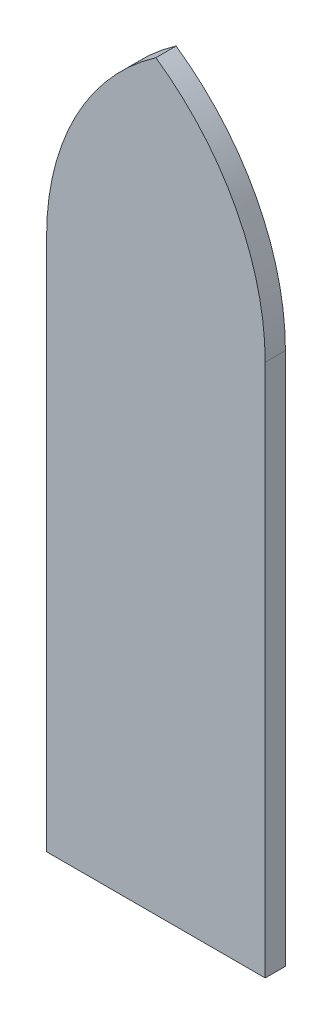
from build123d import *

# Parameters (mm, degrees)
ESQUISSE1_W             = 250
ESQUISSE1_H             = 700
BOSS_EXTRU_1_DEPTH      = 15
ENL_V_MAT_EXTRU_1_DEPTH = 712.231326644


with BuildPart() as part:
    # Esquisse1 → Boss.-Extru.1 (new body)
    with BuildSketch(Plane.XY):
        with Locations((0, 350)):
            Rectangle(ESQUISSE1_W, ESQUISSE1_H)
    extrude(amount=BOSS_EXTRU_1_DEPTH)

    # Esquisse2 → Enl_v. mat.-Extru.1 (cut, through all)
    with BuildSketch(Plane(origin=(0, 0, 0), x_dir=(-1, 0, 0), z_dir=(0, 0, -1))):
        with BuildLine():
            Line((81.126136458, 0), (81.126136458, 395.794919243))
            ThreePointArc((81.126136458, 395.794919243), (59.621349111, 483.35927716), (0, 551))
            ThreePointArc((0, 551), (-59.621349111, 483.35927716), (-81.126136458, 395.794919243))
            Line((-81.126136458, 395.794919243), (-81.126136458, 0))
            Line((-81.126136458, 0), (-125, 0))
            Line((-125, 0), (-125, 700))
            Line((-125, 700), (125, 700))
            Line((125, 700), (125, 0))
            Line((125, 0), (81.126136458, 0))
        make_face()
    extrude(amount=-ENL_V_MAT_EXTRU_1_DEPTH, mode=Mode.SUBTRACT)


solid = part.part
